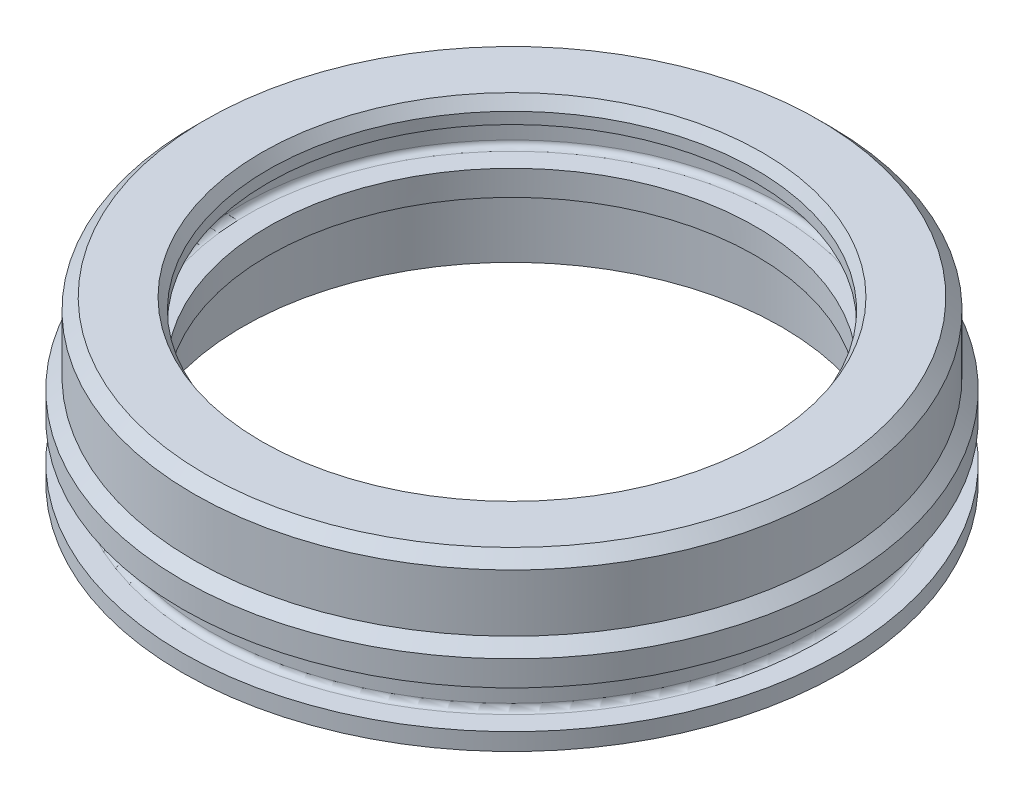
ISO-10303-21;
HEADER;
FILE_DESCRIPTION(('STEP AP214'),'2;1');
FILE_NAME('part.step','',(''),(''),'','','');
FILE_SCHEMA(('AUTOMOTIVE_DESIGN { 1 0 10303 214 1 1 1 1 }'));
ENDSEC;
DATA;
#1=APPLICATION_CONTEXT('core data for automotive mechanical design processes');
#2=APPLICATION_PROTOCOL_DEFINITION('international standard','automotive_design',2000,#1);
#3=PRODUCT_CONTEXT('',#1,'mechanical');
#4=PRODUCT('Part','Part','',(#3));
#5=PRODUCT_RELATED_PRODUCT_CATEGORY('part','',(#4));
#6=PRODUCT_DEFINITION_FORMATION('','',#4);
#7=PRODUCT_DEFINITION_CONTEXT('part definition',#1,'design');
#8=PRODUCT_DEFINITION('design','',#6,#7);
#9=PRODUCT_DEFINITION_SHAPE('','',#8);
#10=(LENGTH_UNIT() NAMED_UNIT(*) SI_UNIT(.MILLI.,.METRE.));
#11=(NAMED_UNIT(*) PLANE_ANGLE_UNIT() SI_UNIT($,.RADIAN.));
#12=(NAMED_UNIT(*) SI_UNIT($,.STERADIAN.) SOLID_ANGLE_UNIT());
#13=UNCERTAINTY_MEASURE_WITH_UNIT(LENGTH_MEASURE(1.E-05),#10,'distance_accuracy_value','');
#14=(GEOMETRIC_REPRESENTATION_CONTEXT(3) GLOBAL_UNCERTAINTY_ASSIGNED_CONTEXT((#13)) GLOBAL_UNIT_ASSIGNED_CONTEXT((#10,
#11,#12)) REPRESENTATION_CONTEXT('',''));
#15=CARTESIAN_POINT('',(0.,0.,0.));
#16=DIRECTION('',(0.,0.,1.));
#17=DIRECTION('',(1.,0.,0.));
#18=AXIS2_PLACEMENT_3D('',#15,#16,#17);
#19=CARTESIAN_POINT('',(0.,-0.00100000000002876,0.));
#20=DIRECTION('',(0.,1.,0.));
#21=DIRECTION('',(0.,0.,1.));
#22=AXIS2_PLACEMENT_3D('',#19,#20,#21);
#23=CYLINDRICAL_SURFACE('',#22,42.5);
#24=CARTESIAN_POINT('',(0.,26.,0.));
#25=DIRECTION('',(0.,1.,0.));
#26=DIRECTION('',(0.,0.,1.));
#27=AXIS2_PLACEMENT_3D('',#24,#25,#26);
#28=CIRCLE('',#27,42.5);
#29=CARTESIAN_POINT('',(0.,26.,42.5));
#30=VERTEX_POINT('',#29);
#31=EDGE_CURVE('E42',#30,#30,#28,.T.);
#32=ORIENTED_EDGE('',*,*,#31,.T.);
#33=EDGE_LOOP('',(#32));
#34=FACE_BOUND('',#33,.T.);
#35=CARTESIAN_POINT('',(0.,24.,0.));
#36=DIRECTION('',(0.,-1.,0.));
#37=DIRECTION('',(0.,0.,-1.));
#38=AXIS2_PLACEMENT_3D('',#35,#36,#37);
#39=CIRCLE('',#38,42.5);
#40=CARTESIAN_POINT('',(0.,24.,-42.5));
#41=VERTEX_POINT('',#40);
#42=EDGE_CURVE('E53',#41,#41,#39,.F.);
#43=ORIENTED_EDGE('',*,*,#42,.F.);
#44=EDGE_LOOP('',(#43));
#45=FACE_BOUND('',#44,.T.);
#46=ADVANCED_FACE('F35',(#34,#45),#23,.F.);
#47=CARTESIAN_POINT('',(0.,13.,0.));
#48=DIRECTION('',(0.,-1.,0.));
#49=DIRECTION('',(0.,0.,-1.));
#50=AXIS2_PLACEMENT_3D('',#47,#48,#49);
#51=CIRCLE('',#50,42.5);
#52=CARTESIAN_POINT('',(0.,13.,-42.5));
#53=VERTEX_POINT('',#52);
#54=EDGE_CURVE('E69',#53,#53,#51,.F.);
#55=ORIENTED_EDGE('',*,*,#54,.F.);
#56=EDGE_LOOP('',(#55));
#57=FACE_BOUND('',#56,.T.);
#58=CARTESIAN_POINT('',(0.,17.39,0.));
#59=DIRECTION('',(0.,1.,0.));
#60=DIRECTION('',(0.,0.,1.));
#61=AXIS2_PLACEMENT_3D('',#58,#59,#60);
#62=CIRCLE('',#61,42.5);
#63=CARTESIAN_POINT('',(0.,17.39,42.5));
#64=VERTEX_POINT('',#63);
#65=EDGE_CURVE('E57',#64,#64,#62,.F.);
#66=ORIENTED_EDGE('',*,*,#65,.F.);
#67=EDGE_LOOP('',(#66));
#68=FACE_BOUND('',#67,.T.);
#69=ADVANCED_FACE('F130',(#57,#68),#23,.F.);
#70=CARTESIAN_POINT('',(0.,0.,0.));
#71=DIRECTION('',(0.,1.,0.));
#72=DIRECTION('',(0.,0.,1.));
#73=AXIS2_PLACEMENT_3D('',#70,#71,#72);
#74=CYLINDRICAL_SURFACE('',#73,57.5);
#75=CARTESIAN_POINT('',(0.,9.61000000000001,0.));
#76=DIRECTION('',(0.,1.,0.));
#77=DIRECTION('',(0.,0.,1.));
#78=AXIS2_PLACEMENT_3D('',#75,#76,#77);
#79=CIRCLE('',#78,57.5);
#80=CARTESIAN_POINT('',(0.,9.61000000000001,57.5));
#81=VERTEX_POINT('',#80);
#82=EDGE_CURVE('E61',#81,#81,#79,.F.);
#83=ORIENTED_EDGE('',*,*,#82,.F.);
#84=EDGE_LOOP('',(#83));
#85=FACE_BOUND('',#84,.T.);
#86=CARTESIAN_POINT('',(0.,14.,0.));
#87=DIRECTION('',(0.,1.,0.));
#88=DIRECTION('',(0.,0.,1.));
#89=AXIS2_PLACEMENT_3D('',#86,#87,#88);
#90=CIRCLE('',#89,57.5);
#91=CARTESIAN_POINT('',(0.,14.,57.5));
#92=VERTEX_POINT('',#91);
#93=EDGE_CURVE('E79',#92,#92,#90,.T.);
#94=ORIENTED_EDGE('',*,*,#93,.F.);
#95=EDGE_LOOP('',(#94));
#96=FACE_BOUND('',#95,.T.);
#97=ADVANCED_FACE('F135',(#85,#96),#74,.T.);
#98=CARTESIAN_POINT('',(-55.5,28.,0.));
#99=DIRECTION('',(0.,1.,0.));
#100=DIRECTION('',(0.,0.,1.));
#101=AXIS2_PLACEMENT_3D('',#98,#99,#100);
#102=PLANE('',#101);
#103=CARTESIAN_POINT('',(0.,28.,0.));
#104=DIRECTION('',(0.,1.,0.));
#105=DIRECTION('',(0.,0.,1.));
#106=AXIS2_PLACEMENT_3D('',#103,#104,#105);
#107=CIRCLE('',#106,43.6547005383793);
#108=CARTESIAN_POINT('',(0.,28.,43.6547005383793));
#109=VERTEX_POINT('',#108);
#110=EDGE_CURVE('E11',#109,#109,#107,.F.);
#111=ORIENTED_EDGE('',*,*,#110,.T.);
#112=EDGE_LOOP('',(#111));
#113=FACE_BOUND('',#112,.T.);
#114=CARTESIAN_POINT('',(0.,28.,0.));
#115=DIRECTION('',(0.,1.,0.));
#116=DIRECTION('',(0.,0.,1.));
#117=AXIS2_PLACEMENT_3D('',#114,#115,#116);
#118=CIRCLE('',#117,53.5);
#119=CARTESIAN_POINT('',(0.,28.,53.5));
#120=VERTEX_POINT('',#119);
#121=EDGE_CURVE('E50',#120,#120,#118,.T.);
#122=ORIENTED_EDGE('',*,*,#121,.T.);
#123=EDGE_LOOP('',(#122));
#124=FACE_BOUND('',#123,.T.);
#125=ADVANCED_FACE('F37',(#113,#124),#102,.T.);
#126=CARTESIAN_POINT('',(0.,0.,0.));
#127=DIRECTION('',(0.,1.,0.));
#128=DIRECTION('',(0.,0.,1.));
#129=AXIS2_PLACEMENT_3D('',#126,#127,#128);
#130=CYLINDRICAL_SURFACE('',#129,55.5);
#131=CARTESIAN_POINT('',(0.,26.,0.));
#132=DIRECTION('',(0.,1.,0.));
#133=DIRECTION('',(0.,0.,1.));
#134=AXIS2_PLACEMENT_3D('',#131,#132,#133);
#135=CIRCLE('',#134,55.5);
#136=CARTESIAN_POINT('',(0.,26.,55.5));
#137=VERTEX_POINT('',#136);
#138=EDGE_CURVE('E46',#137,#137,#135,.F.);
#139=ORIENTED_EDGE('',*,*,#138,.T.);
#140=EDGE_LOOP('',(#139));
#141=FACE_BOUND('',#140,.T.);
#142=CARTESIAN_POINT('',(0.,16.,0.));
#143=DIRECTION('',(0.,1.,0.));
#144=DIRECTION('',(0.,0.,1.));
#145=AXIS2_PLACEMENT_3D('',#142,#143,#144);
#146=CIRCLE('',#145,55.5);
#147=CARTESIAN_POINT('',(0.,16.,55.5));
#148=VERTEX_POINT('',#147);
#149=EDGE_CURVE('E76',#148,#148,#146,.T.);
#150=ORIENTED_EDGE('',*,*,#149,.T.);
#151=EDGE_LOOP('',(#150));
#152=FACE_BOUND('',#151,.T.);
#153=ADVANCED_FACE('F157',(#141,#152),#130,.T.);
#154=CARTESIAN_POINT('',(0.,16.,0.));
#155=DIRECTION('',(0.,-1.,0.));
#156=DIRECTION('',(0.,0.,-1.));
#157=AXIS2_PLACEMENT_3D('',#154,#155,#156);
#158=CONICAL_SURFACE('',#157,55.5,0.785398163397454);
#159=ORIENTED_EDGE('',*,*,#93,.T.);
#160=EDGE_LOOP('',(#159));
#161=FACE_BOUND('',#160,.T.);
#162=ORIENTED_EDGE('',*,*,#149,.F.);
#163=EDGE_LOOP('',(#162));
#164=FACE_BOUND('',#163,.T.);
#165=ADVANCED_FACE('F154',(#161,#164),#158,.T.);
#166=CARTESIAN_POINT('',(0.,3.,0.));
#167=DIRECTION('',(0.,-1.,0.));
#168=DIRECTION('',(0.,0.,-1.));
#169=AXIS2_PLACEMENT_3D('',#166,#167,#168);
#170=CIRCLE('',#169,57.5);
#171=CARTESIAN_POINT('',(0.,3.,-57.5));
#172=VERTEX_POINT('',#171);
#173=EDGE_CURVE('E65',#172,#172,#170,.F.);
#174=ORIENTED_EDGE('',*,*,#173,.F.);
#175=EDGE_LOOP('',(#174));
#176=FACE_BOUND('',#175,.T.);
#177=CARTESIAN_POINT('',(0.,0.,0.));
#178=DIRECTION('',(0.,1.,0.));
#179=DIRECTION('',(0.,0.,1.));
#180=AXIS2_PLACEMENT_3D('',#177,#178,#179);
#181=CIRCLE('',#180,57.5);
#182=CARTESIAN_POINT('',(0.,0.,57.5));
#183=VERTEX_POINT('',#182);
#184=EDGE_CURVE('E71',#183,#183,#181,.T.);
#185=ORIENTED_EDGE('',*,*,#184,.T.);
#186=EDGE_LOOP('',(#185));
#187=FACE_BOUND('',#186,.T.);
#188=ADVANCED_FACE('F150',(#176,#187),#74,.T.);
#189=CARTESIAN_POINT('',(0.,0.,0.));
#190=DIRECTION('',(0.,-1.,0.));
#191=DIRECTION('',(0.,0.,-1.));
#192=AXIS2_PLACEMENT_3D('',#189,#190,#191);
#193=PLANE('',#192);
#194=CARTESIAN_POINT('',(0.,0.,0.));
#195=DIRECTION('',(0.,-1.,0.));
#196=DIRECTION('',(0.,0.,-1.));
#197=AXIS2_PLACEMENT_3D('',#194,#195,#196);
#198=CIRCLE('',#197,47.);
#199=CARTESIAN_POINT('',(0.,0.,-47.));
#200=VERTEX_POINT('',#199);
#201=EDGE_CURVE('E64',#200,#200,#198,.T.);
#202=ORIENTED_EDGE('',*,*,#201,.F.);
#203=EDGE_LOOP('',(#202));
#204=FACE_BOUND('',#203,.T.);
#205=ORIENTED_EDGE('',*,*,#184,.F.);
#206=EDGE_LOOP('',(#205));
#207=FACE_BOUND('',#206,.T.);
#208=ADVANCED_FACE('F146',(#204,#207),#193,.T.);
#209=CARTESIAN_POINT('',(0.,28.,0.));
#210=DIRECTION('',(0.,-1.,0.));
#211=DIRECTION('',(0.,0.,-1.));
#212=AXIS2_PLACEMENT_3D('',#209,#210,#211);
#213=CONICAL_SURFACE('',#212,53.5,0.785398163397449);
#214=ORIENTED_EDGE('',*,*,#138,.F.);
#215=EDGE_LOOP('',(#214));
#216=FACE_BOUND('',#215,.T.);
#217=ORIENTED_EDGE('',*,*,#121,.F.);
#218=EDGE_LOOP('',(#217));
#219=FACE_BOUND('',#218,.T.);
#220=ADVANCED_FACE('F142',(#216,#219),#213,.T.);
#221=CARTESIAN_POINT('',(0.,13.,0.));
#222=DIRECTION('',(0.,-1.,0.));
#223=DIRECTION('',(0.,0.,-1.));
#224=AXIS2_PLACEMENT_3D('',#221,#222,#223);
#225=PLANE('',#224);
#226=CARTESIAN_POINT('',(0.,13.,0.));
#227=DIRECTION('',(0.,-1.,0.));
#228=DIRECTION('',(0.,0.,-1.));
#229=AXIS2_PLACEMENT_3D('',#226,#227,#228);
#230=CIRCLE('',#229,47.);
#231=CARTESIAN_POINT('',(0.,13.,-47.));
#232=VERTEX_POINT('',#231);
#233=EDGE_CURVE('E72',#232,#232,#230,.T.);
#234=ORIENTED_EDGE('',*,*,#233,.T.);
#235=EDGE_LOOP('',(#234));
#236=FACE_BOUND('',#235,.T.);
#237=ORIENTED_EDGE('',*,*,#54,.T.);
#238=EDGE_LOOP('',(#237));
#239=FACE_BOUND('',#238,.T.);
#240=ADVANCED_FACE('F145',(#236,#239),#225,.T.);
#241=CARTESIAN_POINT('',(0.,13.,0.));
#242=DIRECTION('',(0.,-1.,0.));
#243=DIRECTION('',(0.,0.,-1.));
#244=AXIS2_PLACEMENT_3D('',#241,#242,#243);
#245=CYLINDRICAL_SURFACE('',#244,47.);
#246=CARTESIAN_POINT('',(0.,13.,-47.));
#247=CARTESIAN_POINT('',(0.,12.8645833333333,-47.));
#248=CARTESIAN_POINT('',(0.,12.7291666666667,-47.));
#249=CARTESIAN_POINT('',(0.,12.4583333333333,-47.));
#250=CARTESIAN_POINT('',(0.,12.3229166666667,-47.));
#251=CARTESIAN_POINT('',(0.,12.0520833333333,-47.));
#252=CARTESIAN_POINT('',(0.,11.9166666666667,-47.));
#253=CARTESIAN_POINT('',(0.,11.6458333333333,-47.));
#254=CARTESIAN_POINT('',(0.,11.5104166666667,-47.));
#255=CARTESIAN_POINT('',(0.,11.2395833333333,-47.));
#256=CARTESIAN_POINT('',(0.,11.1041666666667,-47.));
#257=CARTESIAN_POINT('',(0.,10.8333333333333,-47.));
#258=CARTESIAN_POINT('',(0.,10.6979166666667,-47.));
#259=CARTESIAN_POINT('',(0.,10.4270833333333,-47.));
#260=CARTESIAN_POINT('',(0.,10.2916666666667,-47.));
#261=CARTESIAN_POINT('',(0.,10.0208333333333,-47.));
#262=CARTESIAN_POINT('',(0.,9.88541666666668,-47.));
#263=CARTESIAN_POINT('',(0.,9.61458333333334,-47.));
#264=CARTESIAN_POINT('',(0.,9.47916666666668,-47.));
#265=CARTESIAN_POINT('',(0.,9.20833333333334,-47.));
#266=CARTESIAN_POINT('',(0.,9.07291666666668,-47.));
#267=CARTESIAN_POINT('',(0.,8.80208333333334,-47.));
#268=CARTESIAN_POINT('',(0.,8.66666666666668,-47.));
#269=CARTESIAN_POINT('',(0.,8.39583333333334,-47.));
#270=CARTESIAN_POINT('',(0.,8.26041666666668,-47.));
#271=CARTESIAN_POINT('',(0.,7.98958333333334,-47.));
#272=CARTESIAN_POINT('',(0.,7.85416666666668,-47.));
#273=CARTESIAN_POINT('',(0.,7.58333333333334,-47.));
#274=CARTESIAN_POINT('',(0.,7.44791666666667,-47.));
#275=CARTESIAN_POINT('',(0.,7.17708333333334,-47.));
#276=CARTESIAN_POINT('',(0.,7.04166666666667,-47.));
#277=CARTESIAN_POINT('',(0.,6.77083333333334,-47.));
#278=CARTESIAN_POINT('',(0.,6.63541666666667,-47.));
#279=CARTESIAN_POINT('',(0.,6.36458333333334,-47.));
#280=CARTESIAN_POINT('',(0.,6.22916666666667,-47.));
#281=CARTESIAN_POINT('',(0.,5.95833333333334,-47.));
#282=CARTESIAN_POINT('',(0.,5.82291666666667,-47.));
#283=CARTESIAN_POINT('',(0.,5.55208333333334,-47.));
#284=CARTESIAN_POINT('',(0.,5.41666666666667,-47.));
#285=CARTESIAN_POINT('',(0.,5.14583333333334,-47.));
#286=CARTESIAN_POINT('',(0.,5.01041666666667,-47.));
#287=CARTESIAN_POINT('',(0.,4.73958333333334,-47.));
#288=CARTESIAN_POINT('',(0.,4.60416666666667,-47.));
#289=CARTESIAN_POINT('',(0.,4.33333333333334,-47.));
#290=CARTESIAN_POINT('',(0.,4.19791666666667,-47.));
#291=CARTESIAN_POINT('',(0.,3.92708333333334,-47.));
#292=CARTESIAN_POINT('',(0.,3.79166666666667,-47.));
#293=CARTESIAN_POINT('',(0.,3.52083333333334,-47.));
#294=CARTESIAN_POINT('',(0.,3.38541666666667,-47.));
#295=CARTESIAN_POINT('',(0.,3.11458333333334,-47.));
#296=CARTESIAN_POINT('',(0.,2.97916666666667,-47.));
#297=CARTESIAN_POINT('',(0.,2.70833333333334,-47.));
#298=CARTESIAN_POINT('',(0.,2.57291666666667,-47.));
#299=CARTESIAN_POINT('',(0.,2.30208333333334,-47.));
#300=CARTESIAN_POINT('',(0.,2.16666666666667,-47.));
#301=CARTESIAN_POINT('',(0.,1.89583333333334,-47.));
#302=CARTESIAN_POINT('',(0.,1.76041666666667,-47.));
#303=CARTESIAN_POINT('',(0.,1.48958333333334,-47.));
#304=CARTESIAN_POINT('',(0.,1.35416666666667,-47.));
#305=CARTESIAN_POINT('',(0.,1.08333333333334,-47.));
#306=CARTESIAN_POINT('',(0.,0.947916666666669,-47.));
#307=CARTESIAN_POINT('',(0.,0.677083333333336,-47.));
#308=CARTESIAN_POINT('',(0.,0.541666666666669,-47.));
#309=CARTESIAN_POINT('',(0.,0.270833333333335,-47.));
#310=CARTESIAN_POINT('',(0.,0.135416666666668,-47.));
#311=CARTESIAN_POINT('',(0.,0.,-47.));
#312=B_SPLINE_CURVE_WITH_KNOTS('',3,(#246,#247,#248,#249,#250,#251,#252,#253,#254,#255,#256,
#257,#258,#259,#260,#261,#262,#263,#264,#265,#266,#267,#268,#269,#270,#271,#272,#273,#274,#275,
#276,#277,#278,#279,#280,#281,#282,#283,#284,#285,#286,#287,#288,#289,#290,#291,#292,#293,#294,
#295,#296,#297,#298,#299,#300,#301,#302,#303,#304,#305,#306,#307,#308,#309,#310,#311),
.UNSPECIFIED.,.F.,.F.,(4,2,2,2,2,2,2,2,2,2,2,2,2,2,2,2,2,2,2,2,2,2,2,2,2,2,2,2,2,2,2,2,4),(0.,
0.406249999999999,0.812499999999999,1.21875,1.625,2.03125,2.4375,2.84375,3.25,3.65625,4.0625,
4.46875,4.875,5.28125,5.6875,6.09375,6.5,6.90625,7.3125,7.71875000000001,8.12500000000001,
8.53125000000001,8.93750000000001,9.34375000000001,9.75000000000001,10.15625,10.5625,10.96875,
11.375,11.78125,12.1875,12.59375,13.),.UNSPECIFIED.);
#313=EDGE_CURVE('BSEAM140',#232,#200,#312,.T.);
#314=ORIENTED_EDGE('',*,*,#233,.F.);
#315=ORIENTED_EDGE('',*,*,#201,.T.);
#316=ORIENTED_EDGE('',*,*,#313,.T.);
#317=ORIENTED_EDGE('',*,*,#313,.F.);
#318=EDGE_LOOP('',(#314,#316,#315,#317));
#319=FACE_BOUND('',#318,.T.);
#320=ADVANCED_FACE('F140',(#319),#245,.F.);
#321=CARTESIAN_POINT('',(-63.2419444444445,9.61000000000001,0.));
#322=DIRECTION('',(0.,1.,0.));
#323=DIRECTION('',(0.,0.,1.));
#324=AXIS2_PLACEMENT_3D('',#321,#322,#323);
#325=PLANE('',#324);
#326=ORIENTED_EDGE('',*,*,#82,.T.);
#327=EDGE_LOOP('',(#326));
#328=FACE_BOUND('',#327,.T.);
#329=CARTESIAN_POINT('',(0.,9.61000000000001,0.));
#330=DIRECTION('',(0.,1.,0.));
#331=DIRECTION('',(0.,0.,1.));
#332=AXIS2_PLACEMENT_3D('',#329,#330,#331);
#333=CIRCLE('',#332,53.86);
#334=CARTESIAN_POINT('',(0.,9.61000000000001,53.86));
#335=VERTEX_POINT('',#334);
#336=EDGE_CURVE('E68',#335,#335,#333,.T.);
#337=ORIENTED_EDGE('',*,*,#336,.T.);
#338=EDGE_LOOP('',(#337));
#339=FACE_BOUND('',#338,.T.);
#340=ADVANCED_FACE('F181',(#328,#339),#325,.F.);
#341=CARTESIAN_POINT('',(0.,8.61000000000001,0.));
#342=DIRECTION('',(0.,1.,0.));
#343=DIRECTION('',(0.,0.,1.));
#344=AXIS2_PLACEMENT_3D('',#341,#342,#343);
#345=TOROIDAL_SURFACE('',#344,53.86,1.);
#346=ORIENTED_EDGE('',*,*,#336,.F.);
#347=EDGE_LOOP('',(#346));
#348=FACE_BOUND('',#347,.T.);
#349=CARTESIAN_POINT('',(0.,8.61000000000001,0.));
#350=DIRECTION('',(0.,1.,0.));
#351=DIRECTION('',(0.,0.,1.));
#352=AXIS2_PLACEMENT_3D('',#349,#350,#351);
#353=CIRCLE('',#352,52.86);
#354=CARTESIAN_POINT('',(0.,8.61000000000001,52.86));
#355=VERTEX_POINT('',#354);
#356=EDGE_CURVE('E90',#355,#355,#353,.T.);
#357=ORIENTED_EDGE('',*,*,#356,.T.);
#358=EDGE_LOOP('',(#357));
#359=FACE_BOUND('',#358,.T.);
#360=ADVANCED_FACE('F184',(#348,#359),#345,.F.);
#361=CARTESIAN_POINT('',(0.,0.,0.));
#362=DIRECTION('',(0.,1.,0.));
#363=DIRECTION('',(0.,0.,1.));
#364=AXIS2_PLACEMENT_3D('',#361,#362,#363);
#365=CYLINDRICAL_SURFACE('',#364,52.86);
#366=ORIENTED_EDGE('',*,*,#356,.F.);
#367=EDGE_LOOP('',(#366));
#368=FACE_BOUND('',#367,.T.);
#369=CARTESIAN_POINT('',(0.,4.,0.));
#370=DIRECTION('',(0.,1.,0.));
#371=DIRECTION('',(0.,0.,1.));
#372=AXIS2_PLACEMENT_3D('',#369,#370,#371);
#373=CIRCLE('',#372,52.86);
#374=CARTESIAN_POINT('',(0.,4.,52.86));
#375=VERTEX_POINT('',#374);
#376=EDGE_CURVE('E93',#375,#375,#373,.T.);
#377=ORIENTED_EDGE('',*,*,#376,.T.);
#378=EDGE_LOOP('',(#377));
#379=FACE_BOUND('',#378,.T.);
#380=ADVANCED_FACE('F190',(#368,#379),#365,.T.);
#381=CARTESIAN_POINT('',(0.,4.,0.));
#382=DIRECTION('',(0.,1.,0.));
#383=DIRECTION('',(0.,0.,1.));
#384=AXIS2_PLACEMENT_3D('',#381,#382,#383);
#385=TOROIDAL_SURFACE('',#384,53.86,1.);
#386=ORIENTED_EDGE('',*,*,#376,.F.);
#387=EDGE_LOOP('',(#386));
#388=FACE_BOUND('',#387,.T.);
#389=CARTESIAN_POINT('',(0.,3.,0.));
#390=DIRECTION('',(0.,1.,0.));
#391=DIRECTION('',(0.,0.,1.));
#392=AXIS2_PLACEMENT_3D('',#389,#390,#391);
#393=CIRCLE('',#392,53.86);
#394=CARTESIAN_POINT('',(0.,3.,53.86));
#395=VERTEX_POINT('',#394);
#396=EDGE_CURVE('E56',#395,#395,#393,.T.);
#397=ORIENTED_EDGE('',*,*,#396,.T.);
#398=EDGE_LOOP('',(#397));
#399=FACE_BOUND('',#398,.T.);
#400=ADVANCED_FACE('F196',(#388,#399),#385,.F.);
#401=CARTESIAN_POINT('',(-63.2419444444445,3.,0.));
#402=DIRECTION('',(0.,-1.,0.));
#403=DIRECTION('',(0.,0.,-1.));
#404=AXIS2_PLACEMENT_3D('',#401,#402,#403);
#405=PLANE('',#404);
#406=ORIENTED_EDGE('',*,*,#173,.T.);
#407=EDGE_LOOP('',(#406));
#408=FACE_BOUND('',#407,.T.);
#409=ORIENTED_EDGE('',*,*,#396,.F.);
#410=EDGE_LOOP('',(#409));
#411=FACE_BOUND('',#410,.T.);
#412=ADVANCED_FACE('F202',(#408,#411),#405,.F.);
#413=CARTESIAN_POINT('',(0.,24.,0.));
#414=DIRECTION('',(0.,-1.,0.));
#415=DIRECTION('',(0.,0.,-1.));
#416=AXIS2_PLACEMENT_3D('',#413,#414,#415);
#417=PLANE('',#416);
#418=CARTESIAN_POINT('',(0.,24.,0.));
#419=DIRECTION('',(0.,1.,0.));
#420=DIRECTION('',(0.,0.,1.));
#421=AXIS2_PLACEMENT_3D('',#418,#419,#420);
#422=CIRCLE('',#421,46.14);
#423=CARTESIAN_POINT('',(0.,24.,46.14));
#424=VERTEX_POINT('',#423);
#425=EDGE_CURVE('E60',#424,#424,#422,.T.);
#426=ORIENTED_EDGE('',*,*,#425,.F.);
#427=EDGE_LOOP('',(#426));
#428=FACE_BOUND('',#427,.T.);
#429=ORIENTED_EDGE('',*,*,#42,.T.);
#430=EDGE_LOOP('',(#429));
#431=FACE_BOUND('',#430,.T.);
#432=ADVANCED_FACE('F207',(#428,#431),#417,.T.);
#433=CARTESIAN_POINT('',(0.,17.39,0.));
#434=DIRECTION('',(0.,1.,0.));
#435=DIRECTION('',(0.,0.,1.));
#436=AXIS2_PLACEMENT_3D('',#433,#434,#435);
#437=PLANE('',#436);
#438=CARTESIAN_POINT('',(0.,17.39,0.));
#439=DIRECTION('',(0.,1.,0.));
#440=DIRECTION('',(0.,0.,1.));
#441=AXIS2_PLACEMENT_3D('',#438,#439,#440);
#442=CIRCLE('',#441,46.14);
#443=CARTESIAN_POINT('',(0.,17.39,46.14));
#444=VERTEX_POINT('',#443);
#445=EDGE_CURVE('E106',#444,#444,#442,.T.);
#446=ORIENTED_EDGE('',*,*,#445,.T.);
#447=EDGE_LOOP('',(#446));
#448=FACE_BOUND('',#447,.T.);
#449=ORIENTED_EDGE('',*,*,#65,.T.);
#450=EDGE_LOOP('',(#449));
#451=FACE_BOUND('',#450,.T.);
#452=ADVANCED_FACE('F110',(#448,#451),#437,.T.);
#453=CARTESIAN_POINT('',(0.,23.,0.));
#454=DIRECTION('',(0.,1.,0.));
#455=DIRECTION('',(0.,0.,1.));
#456=AXIS2_PLACEMENT_3D('',#453,#454,#455);
#457=TOROIDAL_SURFACE('',#456,46.14,1.);
#458=ORIENTED_EDGE('',*,*,#425,.T.);
#459=EDGE_LOOP('',(#458));
#460=FACE_BOUND('',#459,.T.);
#461=CARTESIAN_POINT('',(0.,23.,0.));
#462=DIRECTION('',(0.,1.,0.));
#463=DIRECTION('',(0.,0.,1.));
#464=AXIS2_PLACEMENT_3D('',#461,#462,#463);
#465=CIRCLE('',#464,47.14);
#466=CARTESIAN_POINT('',(0.,23.,47.14));
#467=VERTEX_POINT('',#466);
#468=EDGE_CURVE('E100',#467,#467,#465,.T.);
#469=ORIENTED_EDGE('',*,*,#468,.F.);
#470=EDGE_LOOP('',(#469));
#471=FACE_BOUND('',#470,.T.);
#472=ADVANCED_FACE('F125',(#460,#471),#457,.F.);
#473=CARTESIAN_POINT('',(0.,0.,0.));
#474=DIRECTION('',(0.,1.,0.));
#475=DIRECTION('',(0.,0.,1.));
#476=AXIS2_PLACEMENT_3D('',#473,#474,#475);
#477=CYLINDRICAL_SURFACE('',#476,47.14);
#478=ORIENTED_EDGE('',*,*,#468,.T.);
#479=EDGE_LOOP('',(#478));
#480=FACE_BOUND('',#479,.T.);
#481=CARTESIAN_POINT('',(0.,18.39,0.));
#482=DIRECTION('',(0.,1.,0.));
#483=DIRECTION('',(0.,0.,1.));
#484=AXIS2_PLACEMENT_3D('',#481,#482,#483);
#485=CIRCLE('',#484,47.14);
#486=CARTESIAN_POINT('',(0.,18.39,47.14));
#487=VERTEX_POINT('',#486);
#488=EDGE_CURVE('E103',#487,#487,#485,.T.);
#489=ORIENTED_EDGE('',*,*,#488,.F.);
#490=EDGE_LOOP('',(#489));
#491=FACE_BOUND('',#490,.T.);
#492=ADVANCED_FACE('F116',(#480,#491),#477,.F.);
#493=CARTESIAN_POINT('',(0.,18.39,0.));
#494=DIRECTION('',(0.,1.,0.));
#495=DIRECTION('',(0.,0.,1.));
#496=AXIS2_PLACEMENT_3D('',#493,#494,#495);
#497=TOROIDAL_SURFACE('',#496,46.14,1.);
#498=ORIENTED_EDGE('',*,*,#488,.T.);
#499=EDGE_LOOP('',(#498));
#500=FACE_BOUND('',#499,.T.);
#501=ORIENTED_EDGE('',*,*,#445,.F.);
#502=EDGE_LOOP('',(#501));
#503=FACE_BOUND('',#502,.T.);
#504=ADVANCED_FACE('F113',(#500,#503),#497,.F.);
#505=CARTESIAN_POINT('',(0.,26.,0.));
#506=DIRECTION('',(0.,1.,0.));
#507=DIRECTION('',(0.,0.,1.));
#508=AXIS2_PLACEMENT_3D('',#505,#506,#507);
#509=CONICAL_SURFACE('',#508,42.5,0.523598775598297);
#510=ORIENTED_EDGE('',*,*,#110,.F.);
#511=EDGE_LOOP('',(#510));
#512=FACE_BOUND('',#511,.T.);
#513=ORIENTED_EDGE('',*,*,#31,.F.);
#514=EDGE_LOOP('',(#513));
#515=FACE_BOUND('',#514,.T.);
#516=ADVANCED_FACE('F115',(#512,#515),#509,.F.);
#517=CLOSED_SHELL('',(#46,#69,#97,#125,#153,#165,#188,#208,#220,#240,#320,#340,#360,#380,#400,
#412,#432,#452,#472,#492,#504,#516));
#518=MANIFOLD_SOLID_BREP('B2',#517);
#519=ADVANCED_BREP_SHAPE_REPRESENTATION('',(#18,#518),#14);
#520=SHAPE_DEFINITION_REPRESENTATION(#9,#519);
ENDSEC;
END-ISO-10303-21;
